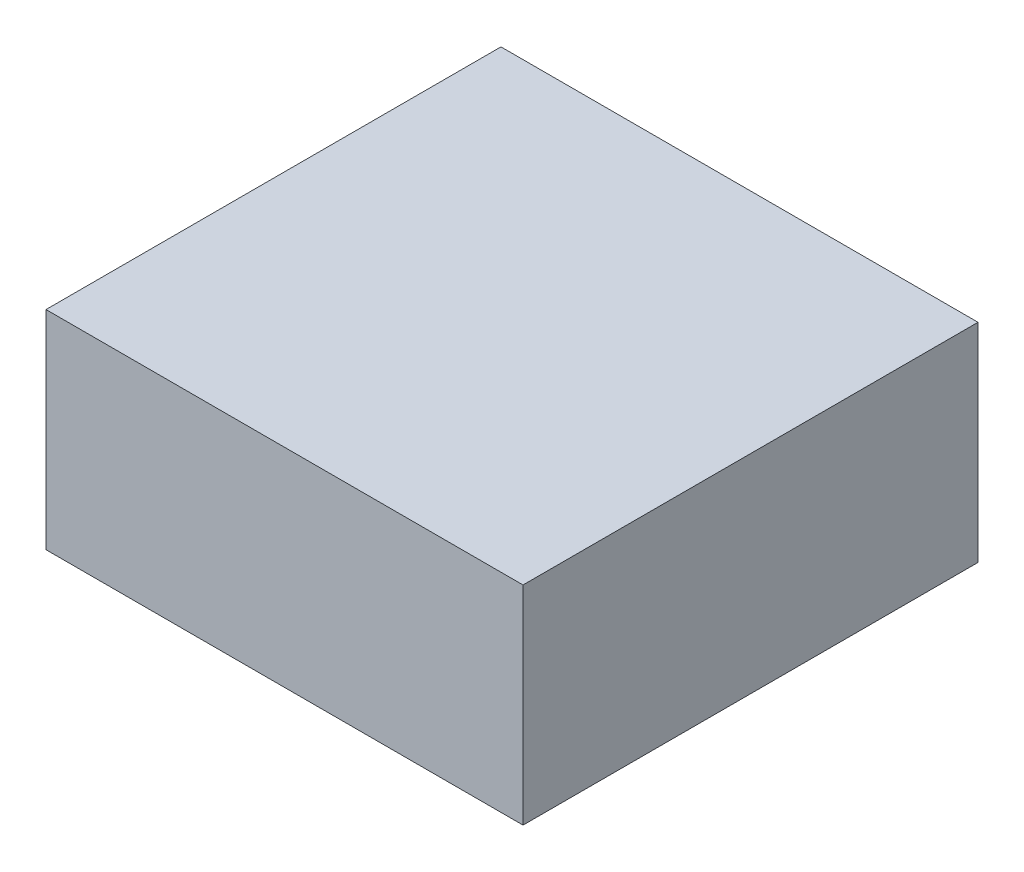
ISO-10303-21;
HEADER;
FILE_DESCRIPTION(('STEP AP214'),'2;1');
FILE_NAME('part.step','',(''),(''),'','','');
FILE_SCHEMA(('AUTOMOTIVE_DESIGN { 1 0 10303 214 1 1 1 1 }'));
ENDSEC;
DATA;
#1=APPLICATION_CONTEXT('core data for automotive mechanical design processes');
#2=APPLICATION_PROTOCOL_DEFINITION('international standard','automotive_design',2000,#1);
#3=PRODUCT_CONTEXT('',#1,'mechanical');
#4=PRODUCT('Part','Part','',(#3));
#5=PRODUCT_RELATED_PRODUCT_CATEGORY('part','',(#4));
#6=PRODUCT_DEFINITION_FORMATION('','',#4);
#7=PRODUCT_DEFINITION_CONTEXT('part definition',#1,'design');
#8=PRODUCT_DEFINITION('design','',#6,#7);
#9=PRODUCT_DEFINITION_SHAPE('','',#8);
#10=(LENGTH_UNIT() NAMED_UNIT(*) SI_UNIT(.MILLI.,.METRE.));
#11=(NAMED_UNIT(*) PLANE_ANGLE_UNIT() SI_UNIT($,.RADIAN.));
#12=(NAMED_UNIT(*) SI_UNIT($,.STERADIAN.) SOLID_ANGLE_UNIT());
#13=UNCERTAINTY_MEASURE_WITH_UNIT(LENGTH_MEASURE(1.E-05),#10,'distance_accuracy_value','');
#14=(GEOMETRIC_REPRESENTATION_CONTEXT(3) GLOBAL_UNCERTAINTY_ASSIGNED_CONTEXT((#13)) GLOBAL_UNIT_ASSIGNED_CONTEXT((#10,
#11,#12)) REPRESENTATION_CONTEXT('',''));
#15=CARTESIAN_POINT('',(0.,0.,0.));
#16=DIRECTION('',(0.,0.,1.));
#17=DIRECTION('',(1.,0.,0.));
#18=AXIS2_PLACEMENT_3D('',#15,#16,#17);
#19=CARTESIAN_POINT('',(-6.5532,2.8575,12.5));
#20=DIRECTION('',(1.,0.,0.));
#21=DIRECTION('',(0.,0.,-1.));
#22=AXIS2_PLACEMENT_3D('',#19,#20,#21);
#23=PLANE('',#22);
#24=DIRECTION('',(0.,-1.,0.));
#25=VECTOR('',#24,1.);
#26=CARTESIAN_POINT('',(-6.5532,2.8575,0.));
#27=LINE('',#26,#25);
#28=CARTESIAN_POINT('',(-6.5532,2.8575,0.));
#29=VERTEX_POINT('',#28);
#30=CARTESIAN_POINT('',(-6.5532,-2.8575,0.));
#31=VERTEX_POINT('',#30);
#32=EDGE_CURVE('E176',#29,#31,#27,.T.);
#33=ORIENTED_EDGE('',*,*,#32,.T.);
#34=DIRECTION('',(0.,0.,-1.));
#35=VECTOR('',#34,1.);
#36=CARTESIAN_POINT('',(-6.5532,-2.8575,12.5));
#37=LINE('',#36,#35);
#38=CARTESIAN_POINT('',(-6.5532,-2.8575,12.5));
#39=VERTEX_POINT('',#38);
#40=EDGE_CURVE('E11',#39,#31,#37,.T.);
#41=ORIENTED_EDGE('',*,*,#40,.F.);
#42=DIRECTION('',(0.,-1.,0.));
#43=VECTOR('',#42,1.);
#44=CARTESIAN_POINT('',(-6.5532,2.8575,12.5));
#45=LINE('',#44,#43);
#46=CARTESIAN_POINT('',(-6.5532,2.8575,12.5));
#47=VERTEX_POINT('',#46);
#48=EDGE_CURVE('E190',#47,#39,#45,.T.);
#49=ORIENTED_EDGE('',*,*,#48,.F.);
#50=DIRECTION('',(0.,0.,-1.));
#51=VECTOR('',#50,1.);
#52=CARTESIAN_POINT('',(-6.5532,2.8575,12.5));
#53=LINE('',#52,#51);
#54=EDGE_CURVE('E199',#47,#29,#53,.T.);
#55=ORIENTED_EDGE('',*,*,#54,.T.);
#56=EDGE_LOOP('',(#33,#41,#49,#55));
#57=FACE_BOUND('',#56,.T.);
#58=ADVANCED_FACE('F27',(#57),#23,.F.);
#59=CARTESIAN_POINT('',(-6.5532,-2.8575,12.5));
#60=DIRECTION('',(0.,1.,0.));
#61=DIRECTION('',(0.,0.,1.));
#62=AXIS2_PLACEMENT_3D('',#59,#60,#61);
#63=PLANE('',#62);
#64=DIRECTION('',(1.,0.,0.));
#65=VECTOR('',#64,1.);
#66=CARTESIAN_POINT('',(-6.5532,-2.8575,0.));
#67=LINE('',#66,#65);
#68=CARTESIAN_POINT('',(6.5532,-2.8575,0.));
#69=VERTEX_POINT('',#68);
#70=EDGE_CURVE('E184',#31,#69,#67,.T.);
#71=ORIENTED_EDGE('',*,*,#70,.T.);
#72=DIRECTION('',(0.,0.,-1.));
#73=VECTOR('',#72,1.);
#74=CARTESIAN_POINT('',(6.5532,-2.8575,12.5));
#75=LINE('',#74,#73);
#76=CARTESIAN_POINT('',(6.5532,-2.8575,12.5));
#77=VERTEX_POINT('',#76);
#78=EDGE_CURVE('E34',#77,#69,#75,.T.);
#79=ORIENTED_EDGE('',*,*,#78,.F.);
#80=DIRECTION('',(1.,0.,0.));
#81=VECTOR('',#80,1.);
#82=CARTESIAN_POINT('',(-6.5532,-2.8575,12.5));
#83=LINE('',#82,#81);
#84=EDGE_CURVE('E193',#39,#77,#83,.T.);
#85=ORIENTED_EDGE('',*,*,#84,.F.);
#86=ORIENTED_EDGE('',*,*,#40,.T.);
#87=EDGE_LOOP('',(#71,#79,#85,#86));
#88=FACE_BOUND('',#87,.T.);
#89=ADVANCED_FACE('F225',(#88),#63,.F.);
#90=CARTESIAN_POINT('',(6.5532,2.8575,12.5));
#91=DIRECTION('',(-1.,0.,0.));
#92=DIRECTION('',(0.,0.,1.));
#93=AXIS2_PLACEMENT_3D('',#90,#91,#92);
#94=PLANE('',#93);
#95=DIRECTION('',(0.,1.,0.));
#96=VECTOR('',#95,1.);
#97=CARTESIAN_POINT('',(6.5532,2.8575,0.));
#98=LINE('',#97,#96);
#99=CARTESIAN_POINT('',(6.5532,2.8575,0.));
#100=VERTEX_POINT('',#99);
#101=EDGE_CURVE('E186',#69,#100,#98,.T.);
#102=ORIENTED_EDGE('',*,*,#101,.T.);
#103=DIRECTION('',(0.,0.,-1.));
#104=VECTOR('',#103,1.);
#105=CARTESIAN_POINT('',(6.5532,2.8575,12.5));
#106=LINE('',#105,#104);
#107=CARTESIAN_POINT('',(6.5532,2.8575,12.5));
#108=VERTEX_POINT('',#107);
#109=EDGE_CURVE('E202',#108,#100,#106,.T.);
#110=ORIENTED_EDGE('',*,*,#109,.F.);
#111=DIRECTION('',(0.,1.,0.));
#112=VECTOR('',#111,1.);
#113=CARTESIAN_POINT('',(6.5532,2.8575,12.5));
#114=LINE('',#113,#112);
#115=EDGE_CURVE('E195',#77,#108,#114,.T.);
#116=ORIENTED_EDGE('',*,*,#115,.F.);
#117=ORIENTED_EDGE('',*,*,#78,.T.);
#118=EDGE_LOOP('',(#102,#110,#116,#117));
#119=FACE_BOUND('',#118,.T.);
#120=ADVANCED_FACE('F209',(#119),#94,.F.);
#121=CARTESIAN_POINT('',(-6.5532,2.8575,12.5));
#122=DIRECTION('',(0.,-1.,0.));
#123=DIRECTION('',(0.,0.,-1.));
#124=AXIS2_PLACEMENT_3D('',#121,#122,#123);
#125=PLANE('',#124);
#126=DIRECTION('',(-1.,0.,0.));
#127=VECTOR('',#126,1.);
#128=CARTESIAN_POINT('',(-6.5532,2.8575,0.));
#129=LINE('',#128,#127);
#130=EDGE_CURVE('E188',#100,#29,#129,.T.);
#131=ORIENTED_EDGE('',*,*,#130,.T.);
#132=ORIENTED_EDGE('',*,*,#54,.F.);
#133=DIRECTION('',(-1.,0.,0.));
#134=VECTOR('',#133,1.);
#135=CARTESIAN_POINT('',(-6.5532,2.8575,12.5));
#136=LINE('',#135,#134);
#137=EDGE_CURVE('E197',#108,#47,#136,.T.);
#138=ORIENTED_EDGE('',*,*,#137,.F.);
#139=ORIENTED_EDGE('',*,*,#109,.T.);
#140=EDGE_LOOP('',(#131,#132,#138,#139));
#141=FACE_BOUND('',#140,.T.);
#142=ADVANCED_FACE('F218',(#141),#125,.F.);
#143=CARTESIAN_POINT('',(-6.5532,-2.8575,12.5));
#144=DIRECTION('',(0.,0.,1.));
#145=DIRECTION('',(1.,0.,0.));
#146=AXIS2_PLACEMENT_3D('',#143,#144,#145);
#147=PLANE('',#146);
#148=ORIENTED_EDGE('',*,*,#48,.T.);
#149=ORIENTED_EDGE('',*,*,#84,.T.);
#150=ORIENTED_EDGE('',*,*,#115,.T.);
#151=ORIENTED_EDGE('',*,*,#137,.T.);
#152=EDGE_LOOP('',(#148,#149,#150,#151));
#153=FACE_BOUND('',#152,.T.);
#154=ADVANCED_FACE('F224',(#153),#147,.T.);
#155=CARTESIAN_POINT('',(-6.5532,-2.8575,0.));
#156=DIRECTION('',(0.,0.,1.));
#157=DIRECTION('',(1.,0.,0.));
#158=AXIS2_PLACEMENT_3D('',#155,#156,#157);
#159=PLANE('',#158);
#160=DIRECTION('',(0.,-1.,0.));
#161=VECTOR('',#160,1.);
#162=CARTESIAN_POINT('',(5.0532,0.,0.));
#163=LINE('',#162,#161);
#164=CARTESIAN_POINT('',(5.0532,1.6425,0.));
#165=VERTEX_POINT('',#164);
#166=CARTESIAN_POINT('',(5.0532,-1.3575,0.));
#167=VERTEX_POINT('',#166);
#168=EDGE_CURVE('E150',#165,#167,#163,.T.);
#169=ORIENTED_EDGE('',*,*,#168,.F.);
#170=DIRECTION('',(1.,0.,0.));
#171=VECTOR('',#170,1.);
#172=CARTESIAN_POINT('',(5.0532,1.6425,0.));
#173=LINE('',#172,#171);
#174=CARTESIAN_POINT('',(-5.0532,1.6425,0.));
#175=VERTEX_POINT('',#174);
#176=EDGE_CURVE('E41',#175,#165,#173,.T.);
#177=ORIENTED_EDGE('',*,*,#176,.F.);
#178=DIRECTION('',(0.,1.,0.));
#179=VECTOR('',#178,1.);
#180=CARTESIAN_POINT('',(-5.0532,1.6425,0.));
#181=LINE('',#180,#179);
#182=CARTESIAN_POINT('',(-5.0532,-1.3575,0.));
#183=VERTEX_POINT('',#182);
#184=EDGE_CURVE('E159',#183,#175,#181,.T.);
#185=ORIENTED_EDGE('',*,*,#184,.F.);
#186=DIRECTION('',(-1.,0.,0.));
#187=VECTOR('',#186,1.);
#188=CARTESIAN_POINT('',(5.0532,-1.3575,0.));
#189=LINE('',#188,#187);
#190=EDGE_CURVE('E156',#167,#183,#189,.T.);
#191=ORIENTED_EDGE('',*,*,#190,.F.);
#192=EDGE_LOOP('',(#169,#177,#185,#191));
#193=FACE_BOUND('',#192,.T.);
#194=ORIENTED_EDGE('',*,*,#32,.F.);
#195=ORIENTED_EDGE('',*,*,#130,.F.);
#196=ORIENTED_EDGE('',*,*,#101,.F.);
#197=ORIENTED_EDGE('',*,*,#70,.F.);
#198=EDGE_LOOP('',(#194,#195,#196,#197));
#199=FACE_BOUND('',#198,.T.);
#200=ADVANCED_FACE('F215',(#193,#199),#159,.F.);
#201=CARTESIAN_POINT('',(5.0532,1.6425,10.));
#202=DIRECTION('',(0.,1.,0.));
#203=DIRECTION('',(0.,0.,1.));
#204=AXIS2_PLACEMENT_3D('',#201,#202,#203);
#205=PLANE('',#204);
#206=ORIENTED_EDGE('',*,*,#176,.T.);
#207=DIRECTION('',(0.,0.,-1.));
#208=VECTOR('',#207,1.);
#209=CARTESIAN_POINT('',(5.0532,1.6425,10.));
#210=LINE('',#209,#208);
#211=CARTESIAN_POINT('',(5.0532,1.6425,10.));
#212=VERTEX_POINT('',#211);
#213=EDGE_CURVE('E174',#212,#165,#210,.T.);
#214=ORIENTED_EDGE('',*,*,#213,.F.);
#215=DIRECTION('',(1.,0.,0.));
#216=VECTOR('',#215,1.);
#217=CARTESIAN_POINT('',(5.0532,1.6425,10.));
#218=LINE('',#217,#216);
#219=CARTESIAN_POINT('',(-5.0532,1.6425,10.));
#220=VERTEX_POINT('',#219);
#221=EDGE_CURVE('E170',#220,#212,#218,.T.);
#222=ORIENTED_EDGE('',*,*,#221,.F.);
#223=DIRECTION('',(0.,0.,-1.));
#224=VECTOR('',#223,1.);
#225=CARTESIAN_POINT('',(-5.0532,1.6425,10.));
#226=LINE('',#225,#224);
#227=EDGE_CURVE('E177',#220,#175,#226,.T.);
#228=ORIENTED_EDGE('',*,*,#227,.T.);
#229=EDGE_LOOP('',(#206,#214,#222,#228));
#230=FACE_BOUND('',#229,.T.);
#231=ADVANCED_FACE('F239',(#230),#205,.F.);
#232=CARTESIAN_POINT('',(-5.0532,1.6425,10.));
#233=DIRECTION('',(-1.,0.,0.));
#234=DIRECTION('',(0.,-1.,0.));
#235=AXIS2_PLACEMENT_3D('',#232,#233,#234);
#236=PLANE('',#235);
#237=ORIENTED_EDGE('',*,*,#184,.T.);
#238=ORIENTED_EDGE('',*,*,#227,.F.);
#239=DIRECTION('',(0.,1.,0.));
#240=VECTOR('',#239,1.);
#241=CARTESIAN_POINT('',(-5.0532,0.,10.));
#242=LINE('',#241,#240);
#243=CARTESIAN_POINT('',(-5.0532,-1.3575,10.));
#244=VERTEX_POINT('',#243);
#245=EDGE_CURVE('E168',#244,#220,#242,.T.);
#246=ORIENTED_EDGE('',*,*,#245,.F.);
#247=DIRECTION('',(0.,0.,-1.));
#248=VECTOR('',#247,1.);
#249=CARTESIAN_POINT('',(-5.0532,-1.3575,10.));
#250=LINE('',#249,#248);
#251=EDGE_CURVE('E179',#244,#183,#250,.T.);
#252=ORIENTED_EDGE('',*,*,#251,.T.);
#253=EDGE_LOOP('',(#237,#238,#246,#252));
#254=FACE_BOUND('',#253,.T.);
#255=ADVANCED_FACE('F249',(#254),#236,.F.);
#256=CARTESIAN_POINT('',(5.0532,-1.3575,10.));
#257=DIRECTION('',(0.,-1.,0.));
#258=DIRECTION('',(0.,0.,-1.));
#259=AXIS2_PLACEMENT_3D('',#256,#257,#258);
#260=PLANE('',#259);
#261=ORIENTED_EDGE('',*,*,#190,.T.);
#262=ORIENTED_EDGE('',*,*,#251,.F.);
#263=DIRECTION('',(-1.,0.,0.));
#264=VECTOR('',#263,1.);
#265=CARTESIAN_POINT('',(5.0532,-1.3575,10.));
#266=LINE('',#265,#264);
#267=CARTESIAN_POINT('',(5.0532,-1.3575,10.));
#268=VERTEX_POINT('',#267);
#269=EDGE_CURVE('E165',#268,#244,#266,.T.);
#270=ORIENTED_EDGE('',*,*,#269,.F.);
#271=DIRECTION('',(0.,0.,-1.));
#272=VECTOR('',#271,1.);
#273=CARTESIAN_POINT('',(5.0532,-1.3575,10.));
#274=LINE('',#273,#272);
#275=EDGE_CURVE('E173',#268,#167,#274,.T.);
#276=ORIENTED_EDGE('',*,*,#275,.T.);
#277=EDGE_LOOP('',(#261,#262,#270,#276));
#278=FACE_BOUND('',#277,.T.);
#279=ADVANCED_FACE('F245',(#278),#260,.F.);
#280=CARTESIAN_POINT('',(5.0532,0.,10.));
#281=DIRECTION('',(1.,0.,0.));
#282=DIRECTION('',(0.,0.,-1.));
#283=AXIS2_PLACEMENT_3D('',#280,#281,#282);
#284=PLANE('',#283);
#285=ORIENTED_EDGE('',*,*,#168,.T.);
#286=ORIENTED_EDGE('',*,*,#275,.F.);
#287=DIRECTION('',(0.,-1.,0.));
#288=VECTOR('',#287,1.);
#289=CARTESIAN_POINT('',(5.0532,0.,10.));
#290=LINE('',#289,#288);
#291=EDGE_CURVE('E163',#212,#268,#290,.T.);
#292=ORIENTED_EDGE('',*,*,#291,.F.);
#293=ORIENTED_EDGE('',*,*,#213,.T.);
#294=EDGE_LOOP('',(#285,#286,#292,#293));
#295=FACE_BOUND('',#294,.T.);
#296=ADVANCED_FACE('F241',(#295),#284,.F.);
#297=CARTESIAN_POINT('',(5.0532,1.6425,10.));
#298=DIRECTION('',(0.,0.,1.));
#299=DIRECTION('',(1.,0.,0.));
#300=AXIS2_PLACEMENT_3D('',#297,#298,#299);
#301=PLANE('',#300);
#302=DIRECTION('',(0.,1.,0.));
#303=VECTOR('',#302,1.);
#304=CARTESIAN_POINT('',(-4.0532,0.,10.));
#305=LINE('',#304,#303);
#306=CARTESIAN_POINT('',(-4.0532,0.,10.));
#307=VERTEX_POINT('',#306);
#308=CARTESIAN_POINT('',(-4.0532,1.1425,10.));
#309=VERTEX_POINT('',#308);
#310=EDGE_CURVE('E130',#307,#309,#305,.T.);
#311=ORIENTED_EDGE('',*,*,#310,.F.);
#312=DIRECTION('',(-1.,0.,0.));
#313=VECTOR('',#312,1.);
#314=CARTESIAN_POINT('',(4.0532,0.,10.));
#315=LINE('',#314,#313);
#316=CARTESIAN_POINT('',(4.0532,0.,10.));
#317=VERTEX_POINT('',#316);
#318=EDGE_CURVE('E147',#317,#307,#315,.T.);
#319=ORIENTED_EDGE('',*,*,#318,.F.);
#320=DIRECTION('',(0.,-1.,0.));
#321=VECTOR('',#320,1.);
#322=CARTESIAN_POINT('',(4.0532,1.1425,10.));
#323=LINE('',#322,#321);
#324=CARTESIAN_POINT('',(4.0532,1.1425,10.));
#325=VERTEX_POINT('',#324);
#326=EDGE_CURVE('E117',#325,#317,#323,.T.);
#327=ORIENTED_EDGE('',*,*,#326,.F.);
#328=DIRECTION('',(1.,0.,0.));
#329=VECTOR('',#328,1.);
#330=CARTESIAN_POINT('',(-4.0532,1.1425,10.));
#331=LINE('',#330,#329);
#332=EDGE_CURVE('E143',#309,#325,#331,.T.);
#333=ORIENTED_EDGE('',*,*,#332,.F.);
#334=EDGE_LOOP('',(#311,#319,#327,#333));
#335=FACE_BOUND('',#334,.T.);
#336=ORIENTED_EDGE('',*,*,#291,.T.);
#337=ORIENTED_EDGE('',*,*,#269,.T.);
#338=ORIENTED_EDGE('',*,*,#245,.T.);
#339=ORIENTED_EDGE('',*,*,#221,.T.);
#340=EDGE_LOOP('',(#336,#337,#338,#339));
#341=FACE_BOUND('',#340,.T.);
#342=ADVANCED_FACE('F244',(#335,#341),#301,.F.);
#343=CARTESIAN_POINT('',(-4.0532,0.,10.));
#344=DIRECTION('',(-1.,0.,0.));
#345=DIRECTION('',(0.,-1.,0.));
#346=AXIS2_PLACEMENT_3D('',#343,#344,#345);
#347=PLANE('',#346);
#348=DIRECTION('',(0.,1.,0.));
#349=VECTOR('',#348,1.);
#350=CARTESIAN_POINT('',(-4.0532,0.,0.));
#351=LINE('',#350,#349);
#352=CARTESIAN_POINT('',(-4.0532,0.,0.));
#353=VERTEX_POINT('',#352);
#354=CARTESIAN_POINT('',(-4.0532,1.1425,0.));
#355=VERTEX_POINT('',#354);
#356=EDGE_CURVE('E137',#353,#355,#351,.T.);
#357=ORIENTED_EDGE('',*,*,#356,.F.);
#358=DIRECTION('',(0.,0.,-1.));
#359=VECTOR('',#358,1.);
#360=CARTESIAN_POINT('',(-4.0532,0.,10.));
#361=LINE('',#360,#359);
#362=EDGE_CURVE('E121',#307,#353,#361,.T.);
#363=ORIENTED_EDGE('',*,*,#362,.F.);
#364=ORIENTED_EDGE('',*,*,#310,.T.);
#365=DIRECTION('',(0.,0.,-1.));
#366=VECTOR('',#365,1.);
#367=CARTESIAN_POINT('',(-4.0532,1.1425,10.));
#368=LINE('',#367,#366);
#369=EDGE_CURVE('E149',#309,#355,#368,.T.);
#370=ORIENTED_EDGE('',*,*,#369,.T.);
#371=EDGE_LOOP('',(#357,#363,#364,#370));
#372=FACE_BOUND('',#371,.T.);
#373=ADVANCED_FACE('F258',(#372),#347,.T.);
#374=CARTESIAN_POINT('',(4.0532,0.,10.));
#375=DIRECTION('',(0.,-1.,0.));
#376=DIRECTION('',(1.,0.,0.));
#377=AXIS2_PLACEMENT_3D('',#374,#375,#376);
#378=PLANE('',#377);
#379=DIRECTION('',(-1.,0.,0.));
#380=VECTOR('',#379,1.);
#381=CARTESIAN_POINT('',(4.0532,0.,0.));
#382=LINE('',#381,#380);
#383=CARTESIAN_POINT('',(4.0532,0.,0.));
#384=VERTEX_POINT('',#383);
#385=EDGE_CURVE('E125',#384,#353,#382,.T.);
#386=ORIENTED_EDGE('',*,*,#385,.F.);
#387=DIRECTION('',(0.,0.,-1.));
#388=VECTOR('',#387,1.);
#389=CARTESIAN_POINT('',(4.0532,0.,10.));
#390=LINE('',#389,#388);
#391=EDGE_CURVE('E114',#317,#384,#390,.T.);
#392=ORIENTED_EDGE('',*,*,#391,.F.);
#393=ORIENTED_EDGE('',*,*,#318,.T.);
#394=ORIENTED_EDGE('',*,*,#362,.T.);
#395=EDGE_LOOP('',(#386,#392,#393,#394));
#396=FACE_BOUND('',#395,.T.);
#397=ADVANCED_FACE('F126',(#396),#378,.T.);
#398=CARTESIAN_POINT('',(4.0532,1.1425,10.));
#399=DIRECTION('',(1.,0.,0.));
#400=DIRECTION('',(0.,0.,-1.));
#401=AXIS2_PLACEMENT_3D('',#398,#399,#400);
#402=PLANE('',#401);
#403=DIRECTION('',(0.,-1.,0.));
#404=VECTOR('',#403,1.);
#405=CARTESIAN_POINT('',(4.0532,1.1425,0.));
#406=LINE('',#405,#404);
#407=CARTESIAN_POINT('',(4.0532,1.1425,0.));
#408=VERTEX_POINT('',#407);
#409=EDGE_CURVE('E49',#408,#384,#406,.T.);
#410=ORIENTED_EDGE('',*,*,#409,.F.);
#411=DIRECTION('',(0.,0.,-1.));
#412=VECTOR('',#411,1.);
#413=CARTESIAN_POINT('',(4.0532,1.1425,10.));
#414=LINE('',#413,#412);
#415=EDGE_CURVE('E122',#325,#408,#414,.T.);
#416=ORIENTED_EDGE('',*,*,#415,.F.);
#417=ORIENTED_EDGE('',*,*,#326,.T.);
#418=ORIENTED_EDGE('',*,*,#391,.T.);
#419=EDGE_LOOP('',(#410,#416,#417,#418));
#420=FACE_BOUND('',#419,.T.);
#421=ADVANCED_FACE('F116',(#420),#402,.T.);
#422=CARTESIAN_POINT('',(-4.0532,1.1425,10.));
#423=DIRECTION('',(0.,1.,0.));
#424=DIRECTION('',(-1.,0.,0.));
#425=AXIS2_PLACEMENT_3D('',#422,#423,#424);
#426=PLANE('',#425);
#427=DIRECTION('',(1.,0.,0.));
#428=VECTOR('',#427,1.);
#429=CARTESIAN_POINT('',(-4.0532,1.1425,0.));
#430=LINE('',#429,#428);
#431=EDGE_CURVE('E135',#355,#408,#430,.T.);
#432=ORIENTED_EDGE('',*,*,#431,.F.);
#433=ORIENTED_EDGE('',*,*,#369,.F.);
#434=ORIENTED_EDGE('',*,*,#332,.T.);
#435=ORIENTED_EDGE('',*,*,#415,.T.);
#436=EDGE_LOOP('',(#432,#433,#434,#435));
#437=FACE_BOUND('',#436,.T.);
#438=ADVANCED_FACE('F263',(#437),#426,.T.);
#439=ORIENTED_EDGE('',*,*,#356,.T.);
#440=ORIENTED_EDGE('',*,*,#431,.T.);
#441=ORIENTED_EDGE('',*,*,#409,.T.);
#442=ORIENTED_EDGE('',*,*,#385,.T.);
#443=EDGE_LOOP('',(#439,#440,#441,#442));
#444=FACE_BOUND('',#443,.T.);
#445=ADVANCED_FACE('F133',(#444),#159,.F.);
#446=CLOSED_SHELL('',(#58,#89,#120,#142,#154,#200,#231,#255,#279,#296,#342,#373,#397,#421,#438,#445));
#447=MANIFOLD_SOLID_BREP('B2',#446);
#448=ADVANCED_BREP_SHAPE_REPRESENTATION('',(#18,#447),#14);
#449=SHAPE_DEFINITION_REPRESENTATION(#9,#448);
ENDSEC;
END-ISO-10303-21;
